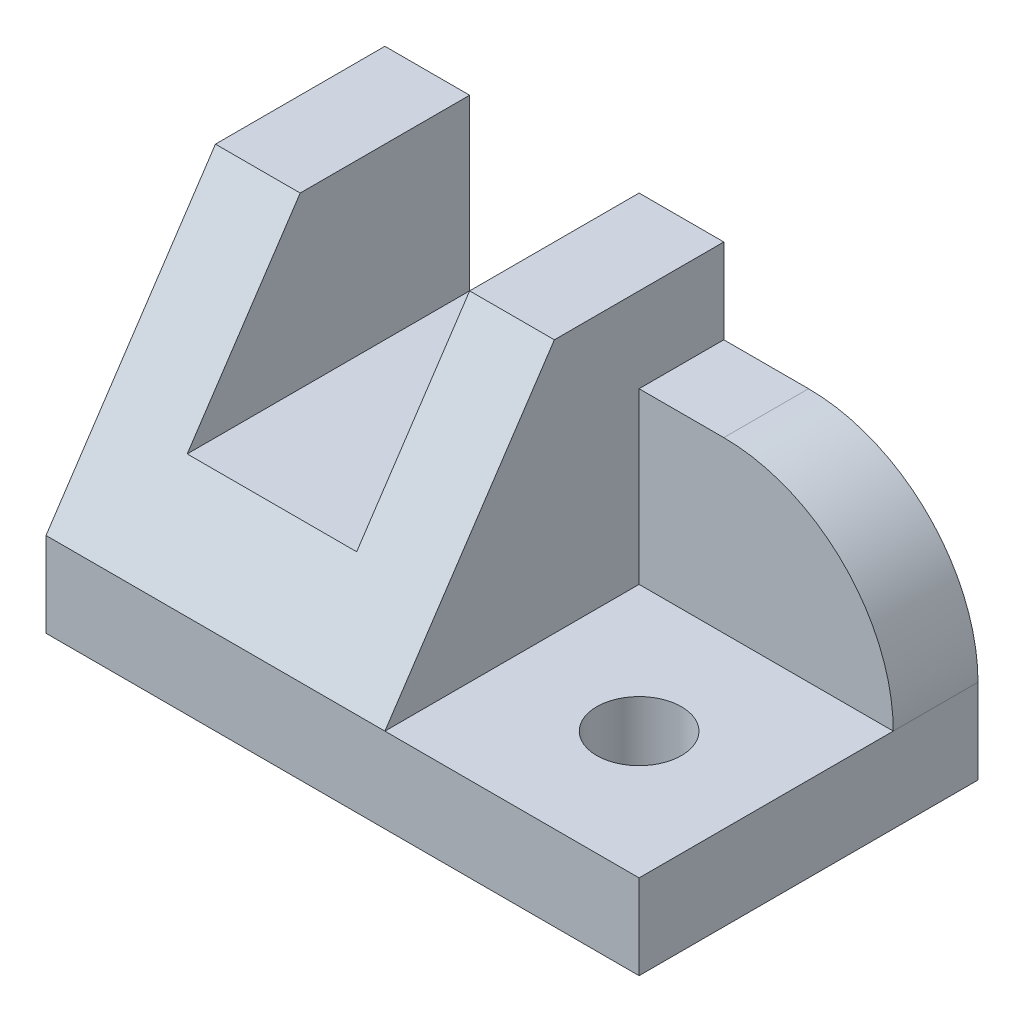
from build123d import *

# Parameters (mm, degrees)
SKETCH1_W      = 70
SKETCH1_H      = 40
EXTRUDE1_DEPTH = 10
EXTRUDE2_DEPTH = 40
SKETCH3_W      = 20
SKETCH3_H      = 20
EXTRUDE3_DEPTH = 91
SKETCH4_W      = 30
SKETCH4_H      = 10
EXTRUDE4_DEPTH = 20
SKETCH5_R      = 5
EXTRUDE5_DEPTH = 87.02325267
FILLET1_R      = 20


with BuildPart() as part:
    # Sketch1 → Extrude1 (new body)
    with BuildSketch(Plane(origin=(0, 0, 0), x_dir=(1, 0, 0), z_dir=(0, 1, 0))):
        with Locations((35, 20)):
            Rectangle(SKETCH1_W, SKETCH1_H)
    extrude(amount=EXTRUDE1_DEPTH)

    # Sketch2 → Extrude2 (add)
    with BuildSketch(Plane(origin=(0, 0, 0), x_dir=(0, 0, -1), z_dir=(1, 0, 0))):
        Polygon((40, 10), (40, 40), (20, 40), (0, 10), align=None)
    extrude(amount=EXTRUDE2_DEPTH)

    # Sketch3 → Extrude3 (cut, through all)
    with BuildSketch(Plane(origin=(0, 0, -40), x_dir=(-1, 0, 0), z_dir=(0, 0, -1))):
        with Locations((-20, 30)):
            Rectangle(SKETCH3_W, SKETCH3_H)
    extrude(amount=-EXTRUDE3_DEPTH, mode=Mode.SUBTRACT)

    # Sketch4 → Extrude4 (add)
    with BuildSketch(Plane(origin=(0, 10, 0), x_dir=(1, 0, 0), z_dir=(0, 1, 0))):
        with Locations((55, 35)):
            Rectangle(SKETCH4_W, SKETCH4_H)
    extrude(amount=EXTRUDE4_DEPTH)

    # Sketch5 → Extrude5 (cut, through all)
    with BuildSketch(Plane(origin=(0, 10, 0), x_dir=(1, 0, 0), z_dir=(0, 1, 0))):
        with Locations(Location((55, 15, 0), (0, 0, 270))):
            Circle(SKETCH5_R)
    extrude(amount=-EXTRUDE5_DEPTH, mode=Mode.SUBTRACT)

    # Fillet1
    fillet1_edges = [part.edges().sort_by_distance(p)[0] for p in [
        (70, 30, -35),
    ]]
    fillet(fillet1_edges, radius=FILLET1_R)


solid = part.part
